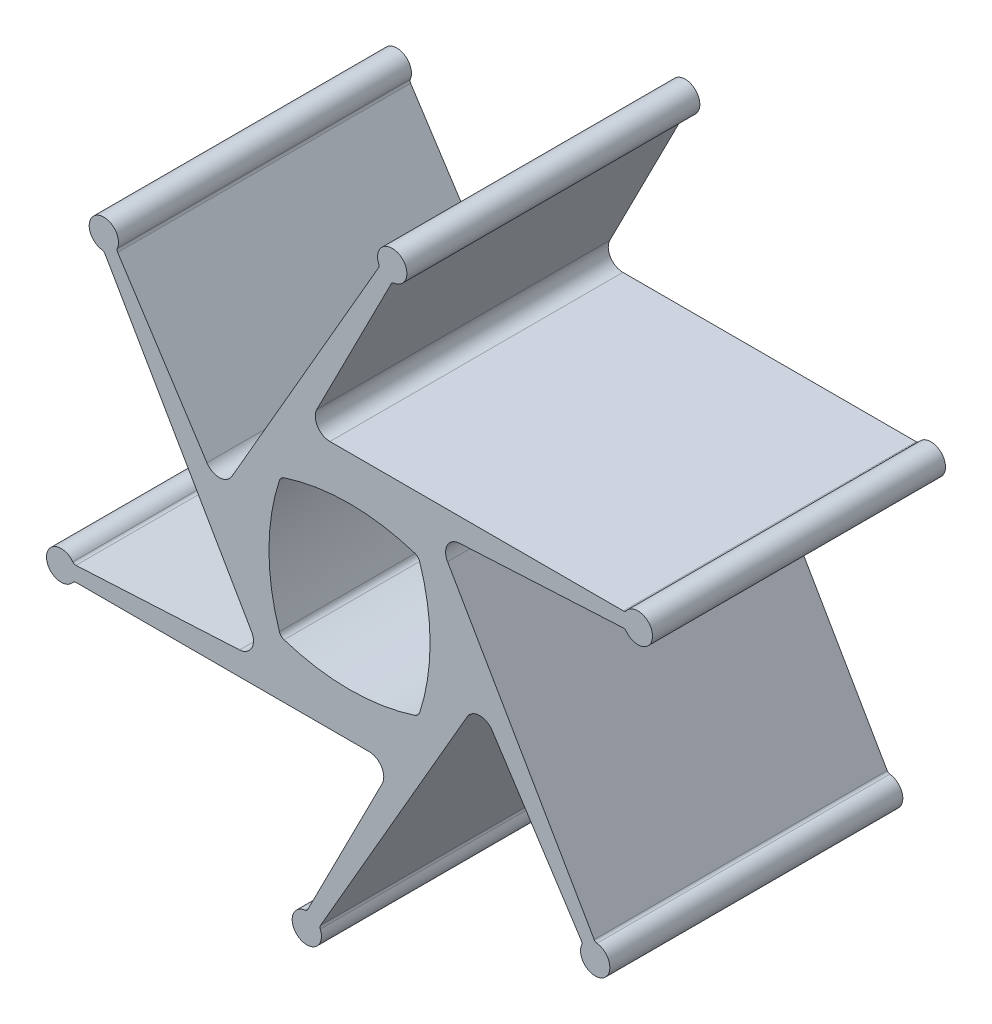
from build123d import *

# Parameters (mm, degrees)
EXTRUSION1_DEPTH = 40


with BuildPart() as part:
    # Esquisse1 → Extrusion1 (new body)
    with BuildSketch(Plane.XY):
        with BuildLine():
            Line((-16.266392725, 6.183192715), (3.757823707, 40.866152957))
            ThreePointArc((3.757823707, 40.866152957), (3.823912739, 41.086195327), (3.784618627, 41.312563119))
            ThreePointArc((3.784618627, 41.312563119), (6.61769155, 43.833795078), (5.877177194, 40.114312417))
            ThreePointArc((5.877177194, 40.114312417), (5.652732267, 40.027221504), (5.495005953, 39.845334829))
            Line((5.495005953, 39.845334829), (-4.663583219, 19.907980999))
            ThreePointArc((-4.663583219, 19.907980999), (-4.586850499, 17.955002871), (-2.881570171, 17))
            Line((-2.881570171, 17), (37.166862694, 17))
            ThreePointArc((37.166862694, 17), (37.390469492, 17.052786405), (37.566862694, 17.2))
            ThreePointArc((37.566862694, 17.2), (41.166850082, 16.007102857), (37.57542643, 14.78866577))
            ThreePointArc((37.57542643, 14.78866577), (37.387781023, 14.939495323), (37.151399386, 14.98514698))
            Line((37.151399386, 14.98514698), (14.805849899, 13.814066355))
            ThreePointArc((14.805849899, 13.814066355), (13.152887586, 12.771124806), (13.178471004, 10.816807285))
            Line((13.178471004, 10.816807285), (33.202687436, -23.866152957))
            ThreePointArc((33.202687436, -23.866152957), (33.360205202, -24.033408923), (33.575892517, -24.112563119))
            ThreePointArc((33.575892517, -24.112563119), (34.342806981, -27.826692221), (31.491897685, -25.325646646))
            ThreePointArc((31.491897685, -25.325646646), (31.528697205, -25.087726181), (31.450041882, -24.860187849))
            Line((31.450041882, -24.860187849), (19.263081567, -6.093914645))
            ThreePointArc((19.263081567, -6.093914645), (17.533386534, -5.183878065), (15.853689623, -6.183192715))
            Line((15.853689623, -6.183192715), (-4.170526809, -40.866152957))
            ThreePointArc((-4.170526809, -40.866152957), (-4.236615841, -41.086195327), (-4.197321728, -41.312563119))
            ThreePointArc((-4.197321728, -41.312563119), (-7.030394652, -43.833795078), (-6.289880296, -40.114312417))
            ThreePointArc((-6.289880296, -40.114312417), (-6.065435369, -40.027221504), (-5.907709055, -39.845334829))
            Line((-5.907709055, -39.845334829), (4.250880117, -19.907980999))
            ThreePointArc((4.250880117, -19.907980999), (4.174147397, -17.955002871), (2.468867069, -17))
            Line((2.468867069, -17), (-37.579565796, -17))
            ThreePointArc((-37.579565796, -17), (-37.803172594, -17.052786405), (-37.979565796, -17.2))
            ThreePointArc((-37.979565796, -17.2), (-41.579553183, -16.007102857), (-37.988129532, -14.78866577))
            ThreePointArc((-37.988129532, -14.78866577), (-37.800484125, -14.939495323), (-37.564102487, -14.98514698))
            Line((-37.564102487, -14.98514698), (-15.218553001, -13.814066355))
            ThreePointArc((-15.218553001, -13.814066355), (-13.565590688, -12.771124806), (-13.591174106, -10.816807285))
            Line((-13.591174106, -10.816807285), (-33.615390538, 23.866152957))
            ThreePointArc((-33.615390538, 23.866152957), (-33.772908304, 24.033408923), (-33.988595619, 24.112563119))
            ThreePointArc((-33.988595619, 24.112563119), (-34.755510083, 27.826692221), (-31.904600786, 25.325646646))
            ThreePointArc((-31.904600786, 25.325646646), (-31.941400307, 25.087726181), (-31.862744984, 24.860187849))
            Line((-31.862744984, 24.860187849), (-19.675784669, 6.093914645))
            ThreePointArc((-19.675784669, 6.093914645), (-17.946089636, 5.183878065), (-16.266392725, 6.183192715))
        make_face()
        with BuildLine():
            ThreePointArc((9.36956141, 8.936273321), (9.126201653, 9.332553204), (8.72992177, 9.575912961))
            ThreePointArc((8.72992177, 9.575912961), (-0.206351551, 11), (-9.142624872, 9.575912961))
            ThreePointArc((-9.142624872, 9.575912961), (-9.538904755, 9.332553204), (-9.782264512, 8.936273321))
            ThreePointArc((-9.782264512, 8.936273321), (-11.206351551, 0), (-9.782264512, -8.936273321))
            ThreePointArc((-9.782264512, -8.936273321), (-9.538904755, -9.332553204), (-9.142624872, -9.575912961))
            ThreePointArc((-9.142624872, -9.575912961), (-0.206351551, -11), (8.72992177, -9.575912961))
            ThreePointArc((8.72992177, -9.575912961), (9.126201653, -9.332553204), (9.36956141, -8.936273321))
            ThreePointArc((9.36956141, -8.936273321), (10.793648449, 0), (9.36956141, 8.936273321))
        make_face(mode=Mode.SUBTRACT)
    extrude(amount=EXTRUSION1_DEPTH)


solid = part.part
